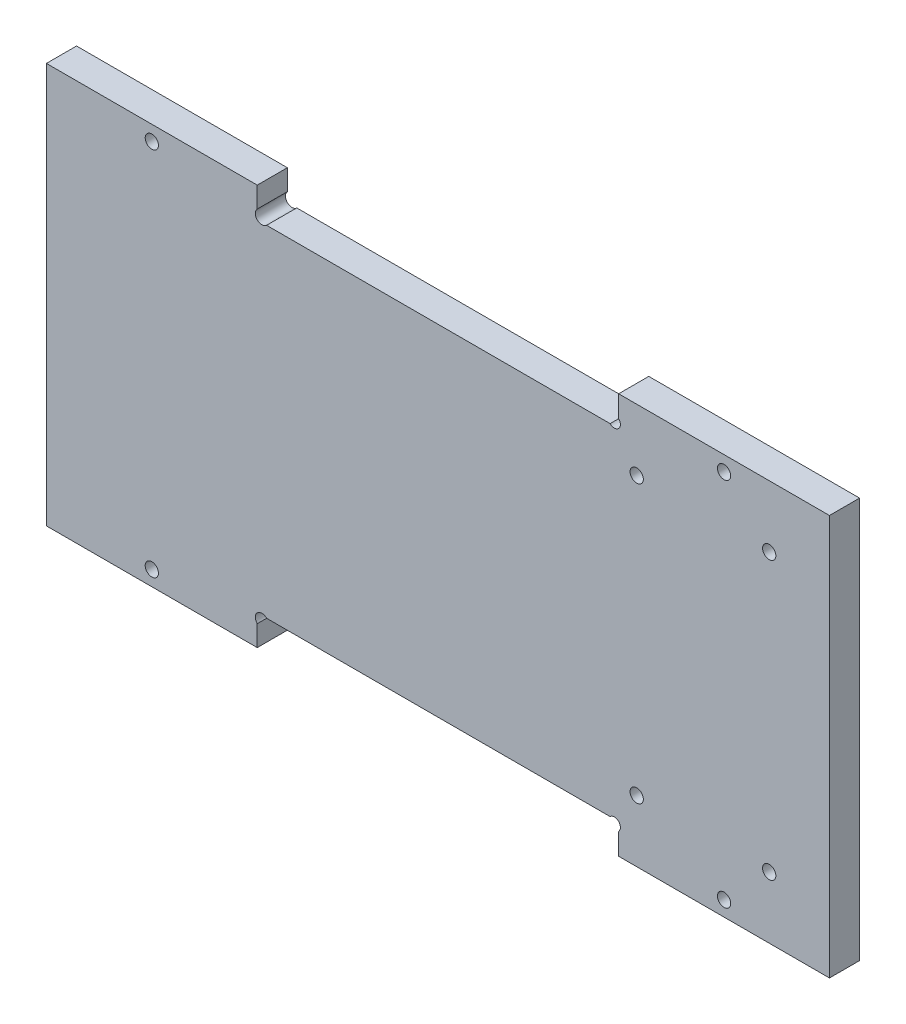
from build123d import *

# Parameters (mm, degrees)
ESQUISSE1_W               = 130
ESQUISSE1_H               = 66.5
BOSS_EXTRU_1_DEPTH        = 5
ENL_V_MAT_EXTRU_2_REACH   = 148.107
ESQUISSE3_R               = 1.1
ENL_V_MAT_EXTRU_4_REACH   = 148.107
ESQUISSE6_W               = 60
ESQUISSE6_H               = 5
ENL_V_START               = -5
ESQUISSE7_R               = 1
ESQUISSE7_R_2             = 1.1
ENL_V_MAT_EXTRU_5_DEPTH   = 5
ENL_V_MAT_EXTRU_6_REACH   = 148.107
ESQUISSE8_R               = 1.1
SYM_TRIE3_COPY_1_REACH    = 148.107
SYM_TRIE3_COPY_1_SKETCH_R = 1.1


with BuildPart() as part:
    # Esquisse1 → Boss.-Extru.1 (new body)
    with BuildSketch(Plane.XY):
        with Locations((65, 33.25)):
            Rectangle(ESQUISSE1_W, ESQUISSE1_H)
    extrude(amount=BOSS_EXTRU_1_DEPTH)

    # Esquisse3 → Enl_v. mat.-Extru.2 (cut, up to next)
    with BuildSketch(Plane.XY.offset(5), mode=Mode.PRIVATE) as enl_v_mat_extru_2_sk1:
        with Locations((120, 56.25)):
            Circle(ESQUISSE3_R)
    enl_v_mat_extru_2_tool1 = extrude(enl_v_mat_extru_2_sk1.sketch, amount=-ENL_V_MAT_EXTRU_2_REACH, mode=Mode.PRIVATE) & part.part
    # Esquisse3 → Enl_v. mat.-Extru.2 (cut, up to next)
    with BuildSketch(Plane.XY.offset(5), mode=Mode.PRIVATE) as enl_v_mat_extru_2_sk2:
        with Locations((120, 10.25)):
            Circle(ESQUISSE3_R)
    enl_v_mat_extru_2_tool2 = extrude(enl_v_mat_extru_2_sk2.sketch, amount=-ENL_V_MAT_EXTRU_2_REACH, mode=Mode.PRIVATE) & part.part
    # Esquisse3 → Enl_v. mat.-Extru.2 (cut, up to next)
    with BuildSketch(Plane.XY.offset(5), mode=Mode.PRIVATE) as enl_v_mat_extru_2_sk3:
        with Locations((98, 10.25)):
            Circle(ESQUISSE3_R)
    enl_v_mat_extru_2_tool3 = extrude(enl_v_mat_extru_2_sk3.sketch, amount=-ENL_V_MAT_EXTRU_2_REACH, mode=Mode.PRIVATE) & part.part
    # Esquisse3 → Enl_v. mat.-Extru.2 (cut, up to next)
    with BuildSketch(Plane.XY.offset(5), mode=Mode.PRIVATE) as enl_v_mat_extru_2_sk4:
        with Locations((98, 56.25)):
            Circle(ESQUISSE3_R)
    enl_v_mat_extru_2_tool4 = extrude(enl_v_mat_extru_2_sk4.sketch, amount=-ENL_V_MAT_EXTRU_2_REACH, mode=Mode.PRIVATE) & part.part
    add(enl_v_mat_extru_2_tool1.solids().sort_by_distance((120, 56.25, 5))[0], mode=Mode.SUBTRACT)
    add(enl_v_mat_extru_2_tool2.solids().sort_by_distance((120, 10.25, 5))[0], mode=Mode.SUBTRACT)
    add(enl_v_mat_extru_2_tool3.solids().sort_by_distance((98, 10.25, 5))[0], mode=Mode.SUBTRACT)
    add(enl_v_mat_extru_2_tool4.solids().sort_by_distance((98, 56.25, 5))[0], mode=Mode.SUBTRACT)

    # Esquisse6 → Enl_v. mat.-Extru.4 (cut, up to next)
    with BuildSketch(Plane(origin=(0, 0, 0), x_dir=(-1, 0, 0), z_dir=(0, 0, -1)), mode=Mode.PRIVATE) as enl_v_mat_extru_4_sk1:
        with Locations((-65, 2.5)):
            Rectangle(ESQUISSE6_W, ESQUISSE6_H)
    enl_v_mat_extru_4_tool1 = extrude(enl_v_mat_extru_4_sk1.sketch, amount=-ENL_V_MAT_EXTRU_4_REACH, mode=Mode.PRIVATE) & part.part
    enl_v_mat_extru_4 = enl_v_mat_extru_4_tool1.solids().sort_by_distance((65, 2.5, 0))[0]
    add(enl_v_mat_extru_4, mode=Mode.SUBTRACT)

    # Esquisse7 → Enl_v. mat.-Extru.5 (cut)
    with BuildSketch(Plane(origin=(0, 0, 0), x_dir=(-1, 0, 0), z_dir=(0, 0, -1)).offset(ENL_V_START)):
        with Locations((-94.292893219, 4.292893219)):
            Circle(ESQUISSE7_R)
        with Locations((-35.777817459, 4.222182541)):
            Circle(ESQUISSE7_R_2)
    enl_v_mat_extru_5 = extrude(amount=ENL_V_MAT_EXTRU_5_DEPTH, mode=Mode.SUBTRACT)

    # Sym_trie1: Enl_v. mat.-Extru.4, Enl_v. mat.-Extru.5 across plane
    add(enl_v_mat_extru_4.mirror(Plane(origin=(0, 33.25, 0), x_dir=(0, 0, 1), z_dir=(0, -1, 0))), mode=Mode.SUBTRACT)
    add(enl_v_mat_extru_5.mirror(Plane(origin=(0, 33.25, 0), x_dir=(0, 0, 1), z_dir=(0, -1, 0))), mode=Mode.SUBTRACT)

    # Esquisse8 → Enl_v. mat.-Extru.6 (cut, up to next)
    with BuildSketch(Plane(origin=(0, 0, 0), x_dir=(-1, 0, 0), z_dir=(0, 0, -1)), mode=Mode.PRIVATE) as enl_v_mat_extru_6_sk1:
        with Locations((-112.5, 2.5)):
            Circle(ESQUISSE8_R)
    enl_v_mat_extru_6_tool1 = extrude(enl_v_mat_extru_6_sk1.sketch, amount=-ENL_V_MAT_EXTRU_6_REACH, mode=Mode.PRIVATE) & part.part
    enl_v_mat_extru_6 = enl_v_mat_extru_6_tool1.solids().sort_by_distance((112.5, 2.5, 0))[0]
    add(enl_v_mat_extru_6, mode=Mode.SUBTRACT)

    # Sym_trie2: Enl_v. mat.-Extru.6 across plane
    add(enl_v_mat_extru_6.mirror(Plane.ZY.offset(-65)), mode=Mode.SUBTRACT)

    # Sym_trie3: Enl_v. mat.-Extru.6 across plane
    add(enl_v_mat_extru_6.mirror(Plane(origin=(0, 33.25, 0), x_dir=(0, 0, 1), z_dir=(0, -1, 0))), mode=Mode.SUBTRACT)

    # Sym_trie3 copy 1 sketch → Sym_trie3 copy 1 (cut, up to next)
    with BuildSketch(Plane(origin=(130, 66.5, 0), x_dir=(1, 0, 0), z_dir=(0, 0, -1)), mode=Mode.PRIVATE) as sym_trie3_copy_1_sk1:
        with Locations((-112.5, 2.5)):
            Circle(SYM_TRIE3_COPY_1_SKETCH_R)
    sym_trie3_copy_1_tool1 = extrude(sym_trie3_copy_1_sk1.sketch, amount=-SYM_TRIE3_COPY_1_REACH, mode=Mode.PRIVATE) & part.part
    add(sym_trie3_copy_1_tool1.solids().sort_by_distance((17.5, 64, 0))[0], mode=Mode.SUBTRACT)


solid = part.part
